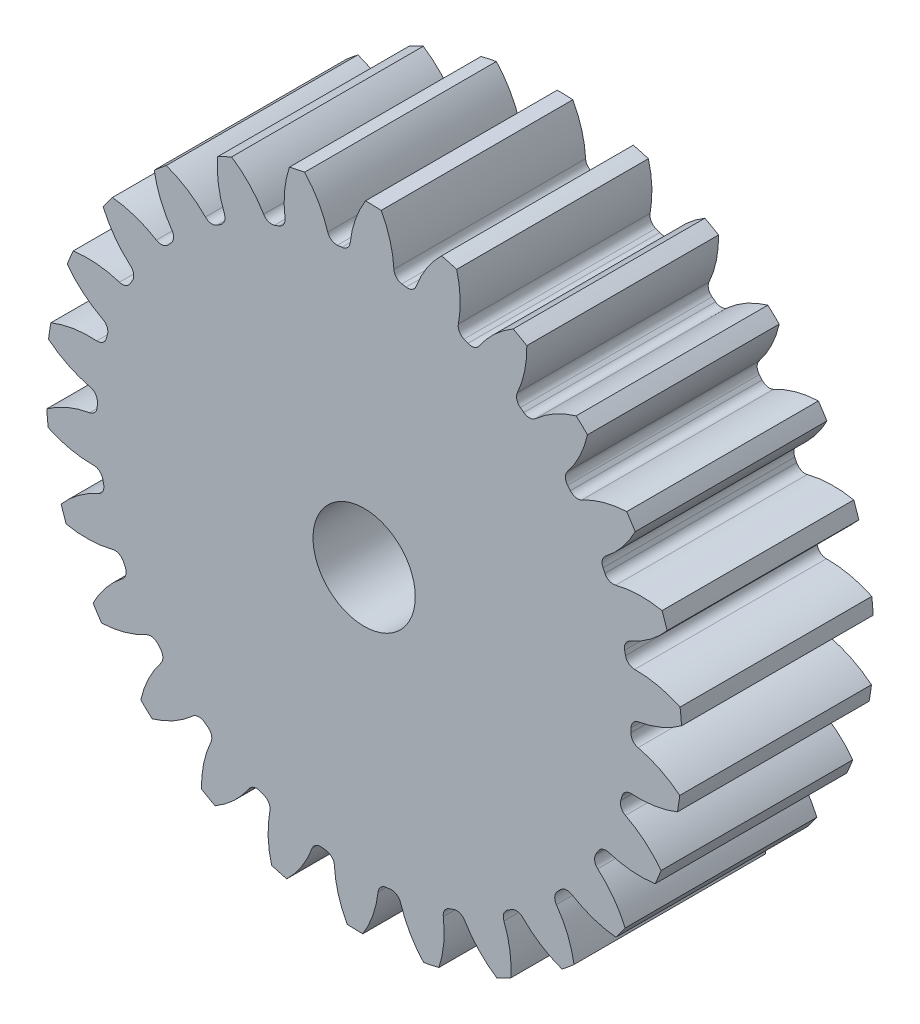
from build123d import *

# Parameters (mm, degrees)
SKETCH3_R         = 158.044444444
GEARBODY_DEPTH    = 95.25
TOOTHCUT_DEPTH    = 243.958134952
CIRPATTERN1_COUNT = 26
BOREDIA_R         = 25.4
BORE_DEPTH        = 12700


with BuildPart() as part:
    # Sketch3 → gearBody (new body)
    with BuildSketch(Plane.XY):
        Circle(SKETCH3_R)
    extrude(amount=GEARBODY_DEPTH)

    # Sketch2 → toothCut (cut, through all)
    with BuildSketch(Plane.XY):
        with BuildLine():
            ThreePointArc((132.553523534, -4.91040128), (132.588961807, -3.836124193), (132.615693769, -2.761595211))
            ThreePointArc((132.615693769, -2.761595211), (133.720762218, 0.132801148), (136.412045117, 1.667631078))
            ThreePointArc((136.412045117, 1.667631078), (147.757484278, 5.036952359), (158.044444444, 10.889282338))
            ThreePointArc((158.044444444, 10.889282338), (158.352873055, -4.5815374), (157.150491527, -20.008645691))
            ThreePointArc((157.150491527, -20.008645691), (147.219100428, -13.571349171), (136.087442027, -9.551710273))
            ThreePointArc((136.087442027, -9.551710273), (133.489399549, -7.863847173), (132.553523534, -4.91040128))
        make_face()
    toothcut = extrude(amount=TOOTHCUT_DEPTH, mode=Mode.SUBTRACT)

    # CirPattern1: toothCut ×26 about axis
    cirpattern1_axis = Axis((0, 0, 0), (0, 0, 1))
    for i in range(1, CIRPATTERN1_COUNT):
        add(toothcut.rotate(cirpattern1_axis, i * 360 / CIRPATTERN1_COUNT), mode=Mode.SUBTRACT)

    # boreDia → bore (cut, symmetric)
    with BuildSketch(Plane.XY):
        Circle(BOREDIA_R)
    extrude(amount=BORE_DEPTH, both=True, mode=Mode.SUBTRACT)


solid = part.part
